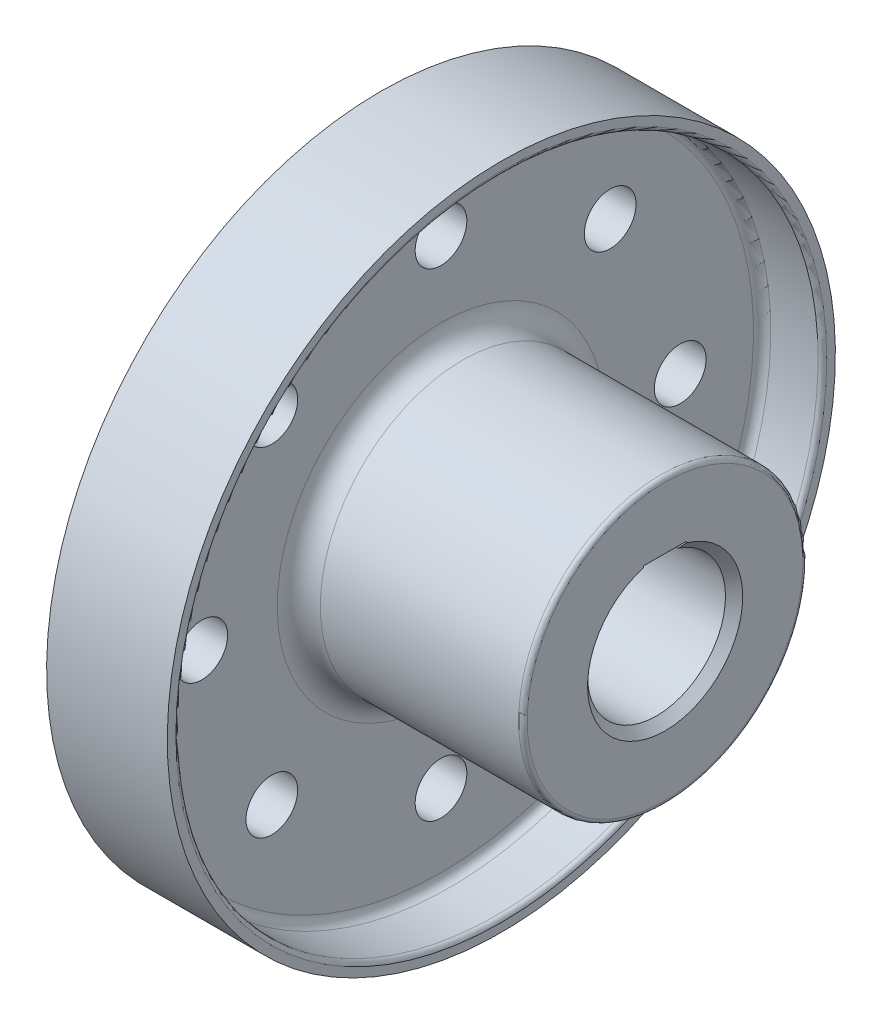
ISO-10303-21;
HEADER;
FILE_DESCRIPTION(('STEP AP214'),'2;1');
FILE_NAME('part.step','',(''),(''),'','','');
FILE_SCHEMA(('AUTOMOTIVE_DESIGN { 1 0 10303 214 1 1 1 1 }'));
ENDSEC;
DATA;
#1=APPLICATION_CONTEXT('core data for automotive mechanical design processes');
#2=APPLICATION_PROTOCOL_DEFINITION('international standard','automotive_design',2000,#1);
#3=PRODUCT_CONTEXT('',#1,'mechanical');
#4=PRODUCT('Part','Part','',(#3));
#5=PRODUCT_RELATED_PRODUCT_CATEGORY('part','',(#4));
#6=PRODUCT_DEFINITION_FORMATION('','',#4);
#7=PRODUCT_DEFINITION_CONTEXT('part definition',#1,'design');
#8=PRODUCT_DEFINITION('design','',#6,#7);
#9=PRODUCT_DEFINITION_SHAPE('','',#8);
#10=(LENGTH_UNIT() NAMED_UNIT(*) SI_UNIT(.MILLI.,.METRE.));
#11=(NAMED_UNIT(*) PLANE_ANGLE_UNIT() SI_UNIT($,.RADIAN.));
#12=(NAMED_UNIT(*) SI_UNIT($,.STERADIAN.) SOLID_ANGLE_UNIT());
#13=UNCERTAINTY_MEASURE_WITH_UNIT(LENGTH_MEASURE(1.E-05),#10,'distance_accuracy_value','');
#14=(GEOMETRIC_REPRESENTATION_CONTEXT(3) GLOBAL_UNCERTAINTY_ASSIGNED_CONTEXT((#13)) GLOBAL_UNIT_ASSIGNED_CONTEXT((#10,
#11,#12)) REPRESENTATION_CONTEXT('',''));
#15=CARTESIAN_POINT('',(0.,0.,0.));
#16=DIRECTION('',(0.,0.,1.));
#17=DIRECTION('',(1.,0.,0.));
#18=AXIS2_PLACEMENT_3D('',#15,#16,#17);
#19=CARTESIAN_POINT('',(7.19163547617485,0.,0.));
#20=DIRECTION('',(1.,0.,0.));
#21=DIRECTION('',(0.,1.,0.));
#22=AXIS2_PLACEMENT_3D('',#19,#20,#21);
#23=PLANE('',#22);
#24=CARTESIAN_POINT('',(7.19163547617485,0.,0.));
#25=DIRECTION('',(1.,0.,0.));
#26=DIRECTION('',(0.,1.,0.));
#27=AXIS2_PLACEMENT_3D('',#24,#25,#26);
#28=CIRCLE('',#27,32.);
#29=CARTESIAN_POINT('',(7.19163547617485,32.,0.));
#30=VERTEX_POINT('',#29);
#31=EDGE_CURVE('E275',#30,#30,#28,.T.);
#32=ORIENTED_EDGE('',*,*,#31,.T.);
#33=EDGE_LOOP('',(#32));
#34=FACE_BOUND('',#33,.T.);
#35=DIRECTION('',(0.,-1.,0.));
#36=VECTOR('',#35,1.);
#37=CARTESIAN_POINT('',(7.19163547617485,17.65,-5.));
#38=LINE('',#37,#36);
#39=CARTESIAN_POINT('',(7.19163547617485,17.65,-5.));
#40=VERTEX_POINT('',#39);
#41=CARTESIAN_POINT('',(7.19163547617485,17.2916164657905,-5.));
#42=VERTEX_POINT('',#41);
#43=EDGE_CURVE('E158',#40,#42,#38,.T.);
#44=ORIENTED_EDGE('',*,*,#43,.T.);
#45=CARTESIAN_POINT('',(7.19163547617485,0.,0.));
#46=DIRECTION('',(1.,0.,0.));
#47=DIRECTION('',(0.,1.,0.));
#48=AXIS2_PLACEMENT_3D('',#45,#46,#47);
#49=CIRCLE('',#48,17.9999999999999);
#50=CARTESIAN_POINT('',(7.19163547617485,17.2916164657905,5.));
#51=VERTEX_POINT('',#50);
#52=EDGE_CURVE('E184',#42,#51,#49,.F.);
#53=ORIENTED_EDGE('',*,*,#52,.T.);
#54=DIRECTION('',(0.,-1.,0.));
#55=VECTOR('',#54,1.);
#56=CARTESIAN_POINT('',(7.19163547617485,17.65,5.));
#57=LINE('',#56,#55);
#58=CARTESIAN_POINT('',(7.19163547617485,17.65,5.));
#59=VERTEX_POINT('',#58);
#60=EDGE_CURVE('E155',#59,#51,#57,.T.);
#61=ORIENTED_EDGE('',*,*,#60,.F.);
#62=DIRECTION('',(0.,0.,1.));
#63=VECTOR('',#62,1.);
#64=CARTESIAN_POINT('',(7.19163547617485,17.65,-5.));
#65=LINE('',#64,#63);
#66=EDGE_CURVE('E134',#40,#59,#65,.T.);
#67=ORIENTED_EDGE('',*,*,#66,.F.);
#68=EDGE_LOOP('',(#44,#53,#61,#67));
#69=FACE_BOUND('',#68,.T.);
#70=ADVANCED_FACE('F68',(#34,#69),#23,.T.);
#71=CARTESIAN_POINT('',(7.19163547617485,0.,0.));
#72=DIRECTION('',(1.,0.,0.));
#73=DIRECTION('',(0.,1.,0.));
#74=AXIS2_PLACEMENT_3D('',#71,#72,#73);
#75=CYLINDRICAL_SURFACE('',#74,33.);
#76=CARTESIAN_POINT('',(-39.8083645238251,0.,0.));
#77=DIRECTION('',(1.,0.,0.));
#78=DIRECTION('',(0.,1.,0.));
#79=AXIS2_PLACEMENT_3D('',#76,#77,#78);
#80=CIRCLE('',#79,33.);
#81=CARTESIAN_POINT('',(-39.8083645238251,33.,0.));
#82=VERTEX_POINT('',#81);
#83=EDGE_CURVE('E77',#82,#82,#80,.T.);
#84=ORIENTED_EDGE('',*,*,#83,.T.);
#85=EDGE_LOOP('',(#84));
#86=FACE_BOUND('',#85,.T.);
#87=CARTESIAN_POINT('',(6.19163547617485,0.,0.));
#88=DIRECTION('',(1.,0.,0.));
#89=DIRECTION('',(0.,1.,0.));
#90=AXIS2_PLACEMENT_3D('',#87,#88,#89);
#91=CIRCLE('',#90,33.);
#92=CARTESIAN_POINT('',(6.19163547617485,33.,0.));
#93=VERTEX_POINT('',#92);
#94=EDGE_CURVE('E300',#93,#93,#91,.F.);
#95=ORIENTED_EDGE('',*,*,#94,.T.);
#96=EDGE_LOOP('',(#95));
#97=FACE_BOUND('',#96,.T.);
#98=ADVANCED_FACE('F265',(#86,#97),#75,.T.);
#99=CARTESIAN_POINT('',(-44.8083645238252,33.,0.));
#100=DIRECTION('',(1.,0.,0.));
#101=DIRECTION('',(0.,1.,0.));
#102=AXIS2_PLACEMENT_3D('',#99,#100,#101);
#103=PLANE('',#102);
#104=CARTESIAN_POINT('',(-44.8083645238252,55.5,0.));
#105=DIRECTION('',(1.,0.,0.));
#106=DIRECTION('',(0.,1.,0.));
#107=AXIS2_PLACEMENT_3D('',#104,#105,#106);
#108=CIRCLE('',#107,6.);
#109=CARTESIAN_POINT('',(-44.8083645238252,61.5,0.));
#110=VERTEX_POINT('',#109);
#111=EDGE_CURVE('E148',#110,#110,#108,.T.);
#112=ORIENTED_EDGE('',*,*,#111,.F.);
#113=EDGE_LOOP('',(#112));
#114=FACE_BOUND('',#113,.T.);
#115=CARTESIAN_POINT('',(-44.8083645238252,39.2444263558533,39.2444263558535));
#116=DIRECTION('',(1.,0.,0.));
#117=DIRECTION('',(0.,1.,0.));
#118=AXIS2_PLACEMENT_3D('',#115,#116,#117);
#119=CIRCLE('',#118,6.);
#120=CARTESIAN_POINT('',(-44.8083645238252,45.2444263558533,39.2444263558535));
#121=VERTEX_POINT('',#120);
#122=EDGE_CURVE('E649',#121,#121,#119,.T.);
#123=ORIENTED_EDGE('',*,*,#122,.F.);
#124=EDGE_LOOP('',(#123));
#125=FACE_BOUND('',#124,.T.);
#126=CARTESIAN_POINT('',(-44.8083645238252,-1.91846352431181E-13,55.5));
#127=DIRECTION('',(1.,0.,0.));
#128=DIRECTION('',(0.,1.,0.));
#129=AXIS2_PLACEMENT_3D('',#126,#127,#128);
#130=CIRCLE('',#129,6.);
#131=CARTESIAN_POINT('',(-44.8083645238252,5.99999999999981,55.5));
#132=VERTEX_POINT('',#131);
#133=EDGE_CURVE('E646',#132,#132,#130,.T.);
#134=ORIENTED_EDGE('',*,*,#133,.F.);
#135=EDGE_LOOP('',(#134));
#136=FACE_BOUND('',#135,.T.);
#137=CARTESIAN_POINT('',(-44.8083645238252,-39.2444263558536,39.2444263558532));
#138=DIRECTION('',(1.,0.,0.));
#139=DIRECTION('',(0.,1.,0.));
#140=AXIS2_PLACEMENT_3D('',#137,#138,#139);
#141=CIRCLE('',#140,5.99999999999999);
#142=CARTESIAN_POINT('',(-44.8083645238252,-33.2444263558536,39.2444263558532));
#143=VERTEX_POINT('',#142);
#144=EDGE_CURVE('E642',#143,#143,#141,.T.);
#145=ORIENTED_EDGE('',*,*,#144,.F.);
#146=EDGE_LOOP('',(#145));
#147=FACE_BOUND('',#146,.T.);
#148=CARTESIAN_POINT('',(-44.8083645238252,-55.5,-3.87554428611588E-13));
#149=DIRECTION('',(1.,0.,0.));
#150=DIRECTION('',(0.,1.,0.));
#151=AXIS2_PLACEMENT_3D('',#148,#149,#150);
#152=CIRCLE('',#151,6.);
#153=CARTESIAN_POINT('',(-44.8083645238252,-49.5,-3.87554428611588E-13));
#154=VERTEX_POINT('',#153);
#155=EDGE_CURVE('E638',#154,#154,#152,.T.);
#156=ORIENTED_EDGE('',*,*,#155,.F.);
#157=EDGE_LOOP('',(#156));
#158=FACE_BOUND('',#157,.T.);
#159=CARTESIAN_POINT('',(-44.8083645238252,-39.2444263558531,-39.2444263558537));
#160=DIRECTION('',(1.,0.,0.));
#161=DIRECTION('',(0.,1.,0.));
#162=AXIS2_PLACEMENT_3D('',#159,#160,#161);
#163=CIRCLE('',#162,6.);
#164=CARTESIAN_POINT('',(-44.8083645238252,-33.244426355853,-39.2444263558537));
#165=VERTEX_POINT('',#164);
#166=EDGE_CURVE('E634',#165,#165,#163,.T.);
#167=ORIENTED_EDGE('',*,*,#166,.F.);
#168=EDGE_LOOP('',(#167));
#169=FACE_BOUND('',#168,.T.);
#170=CARTESIAN_POINT('',(-44.8083645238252,5.83262504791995E-13,-55.5));
#171=DIRECTION('',(1.,0.,0.));
#172=DIRECTION('',(0.,1.,0.));
#173=AXIS2_PLACEMENT_3D('',#170,#171,#172);
#174=CIRCLE('',#173,6.);
#175=CARTESIAN_POINT('',(-44.8083645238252,6.00000000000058,-55.5));
#176=VERTEX_POINT('',#175);
#177=EDGE_CURVE('E630',#176,#176,#174,.T.);
#178=ORIENTED_EDGE('',*,*,#177,.F.);
#179=EDGE_LOOP('',(#178));
#180=FACE_BOUND('',#179,.T.);
#181=CARTESIAN_POINT('',(-44.8083645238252,39.2444263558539,-39.2444263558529));
#182=DIRECTION('',(1.,0.,0.));
#183=DIRECTION('',(0.,1.,0.));
#184=AXIS2_PLACEMENT_3D('',#181,#182,#183);
#185=CIRCLE('',#184,6.);
#186=CARTESIAN_POINT('',(-44.8083645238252,45.2444263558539,-39.2444263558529));
#187=VERTEX_POINT('',#186);
#188=EDGE_CURVE('E626',#187,#187,#185,.T.);
#189=ORIENTED_EDGE('',*,*,#188,.F.);
#190=EDGE_LOOP('',(#189));
#191=FACE_BOUND('',#190,.T.);
#192=CARTESIAN_POINT('',(-44.8083645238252,0.,0.));
#193=DIRECTION('',(1.,0.,0.));
#194=DIRECTION('',(0.,1.,0.));
#195=AXIS2_PLACEMENT_3D('',#192,#193,#194);
#196=CIRCLE('',#195,38.);
#197=CARTESIAN_POINT('',(-44.8083645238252,38.,0.));
#198=VERTEX_POINT('',#197);
#199=EDGE_CURVE('E12',#198,#198,#196,.F.);
#200=ORIENTED_EDGE('',*,*,#199,.T.);
#201=EDGE_LOOP('',(#200));
#202=FACE_BOUND('',#201,.T.);
#203=CARTESIAN_POINT('',(-44.8083645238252,0.,0.));
#204=DIRECTION('',(1.,0.,0.));
#205=DIRECTION('',(0.,1.,0.));
#206=AXIS2_PLACEMENT_3D('',#203,#204,#205);
#207=CIRCLE('',#206,72.5);
#208=CARTESIAN_POINT('',(-44.8083645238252,72.5,0.));
#209=VERTEX_POINT('',#208);
#210=EDGE_CURVE('E305',#209,#209,#207,.T.);
#211=ORIENTED_EDGE('',*,*,#210,.T.);
#212=EDGE_LOOP('',(#211));
#213=FACE_BOUND('',#212,.T.);
#214=ADVANCED_FACE('F270',(#114,#125,#136,#147,#158,#169,#180,#191,#202,#213),#103,.T.);
#215=CARTESIAN_POINT('',(7.19163547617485,0.,0.));
#216=DIRECTION('',(1.,0.,0.));
#217=DIRECTION('',(0.,1.,0.));
#218=AXIS2_PLACEMENT_3D('',#215,#216,#217);
#219=CYLINDRICAL_SURFACE('',#218,74.5);
#220=CARTESIAN_POINT('',(-42.8083645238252,0.,0.));
#221=DIRECTION('',(1.,0.,0.));
#222=DIRECTION('',(0.,1.,0.));
#223=AXIS2_PLACEMENT_3D('',#220,#221,#222);
#224=CIRCLE('',#223,74.5);
#225=CARTESIAN_POINT('',(-42.8083645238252,74.5,0.));
#226=VERTEX_POINT('',#225);
#227=EDGE_CURVE('E310',#226,#226,#224,.F.);
#228=ORIENTED_EDGE('',*,*,#227,.T.);
#229=EDGE_LOOP('',(#228));
#230=FACE_BOUND('',#229,.T.);
#231=CARTESIAN_POINT('',(-31.8083645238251,0.,0.));
#232=DIRECTION('',(1.,0.,0.));
#233=DIRECTION('',(0.,1.,0.));
#234=AXIS2_PLACEMENT_3D('',#231,#232,#233);
#235=CIRCLE('',#234,74.5);
#236=CARTESIAN_POINT('',(-31.8083645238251,74.5,0.));
#237=VERTEX_POINT('',#236);
#238=EDGE_CURVE('E222',#237,#237,#235,.T.);
#239=ORIENTED_EDGE('',*,*,#238,.T.);
#240=EDGE_LOOP('',(#239));
#241=FACE_BOUND('',#240,.T.);
#242=ADVANCED_FACE('F334',(#230,#241),#219,.F.);
#243=CARTESIAN_POINT('',(-30.8083645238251,74.5,0.));
#244=DIRECTION('',(1.,0.,0.));
#245=DIRECTION('',(0.,1.,0.));
#246=AXIS2_PLACEMENT_3D('',#243,#244,#245);
#247=PLANE('',#246);
#248=CARTESIAN_POINT('',(-30.8083645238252,0.,0.));
#249=DIRECTION('',(1.,0.,0.));
#250=DIRECTION('',(0.,1.,0.));
#251=AXIS2_PLACEMENT_3D('',#248,#249,#250);
#252=CIRCLE('',#251,75.5);
#253=CARTESIAN_POINT('',(-30.8083645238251,75.5,0.));
#254=VERTEX_POINT('',#253);
#255=EDGE_CURVE('E294',#254,#254,#252,.F.);
#256=ORIENTED_EDGE('',*,*,#255,.T.);
#257=EDGE_LOOP('',(#256));
#258=FACE_BOUND('',#257,.T.);
#259=CARTESIAN_POINT('',(-30.8083645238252,0.,0.));
#260=DIRECTION('',(1.,0.,0.));
#261=DIRECTION('',(0.,1.,0.));
#262=AXIS2_PLACEMENT_3D('',#259,#260,#261);
#263=CIRCLE('',#262,77.5);
#264=CARTESIAN_POINT('',(-30.8083645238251,77.5,0.));
#265=VERTEX_POINT('',#264);
#266=EDGE_CURVE('E180',#265,#265,#263,.T.);
#267=ORIENTED_EDGE('',*,*,#266,.T.);
#268=EDGE_LOOP('',(#267));
#269=FACE_BOUND('',#268,.T.);
#270=ADVANCED_FACE('F342',(#258,#269),#247,.T.);
#271=CARTESIAN_POINT('',(7.19163547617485,0.,0.));
#272=DIRECTION('',(1.,0.,0.));
#273=DIRECTION('',(0.,1.,0.));
#274=AXIS2_PLACEMENT_3D('',#271,#272,#273);
#275=CYLINDRICAL_SURFACE('',#274,77.5);
#276=CARTESIAN_POINT('',(-58.8083645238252,0.,0.));
#277=DIRECTION('',(1.,0.,0.));
#278=DIRECTION('',(0.,1.,0.));
#279=AXIS2_PLACEMENT_3D('',#276,#277,#278);
#280=CIRCLE('',#279,77.5);
#281=CARTESIAN_POINT('',(-58.8083645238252,77.5,0.));
#282=VERTEX_POINT('',#281);
#283=EDGE_CURVE('E173',#282,#282,#280,.T.);
#284=ORIENTED_EDGE('',*,*,#283,.T.);
#285=EDGE_LOOP('',(#284));
#286=FACE_BOUND('',#285,.T.);
#287=ORIENTED_EDGE('',*,*,#266,.F.);
#288=EDGE_LOOP('',(#287));
#289=FACE_BOUND('',#288,.T.);
#290=ADVANCED_FACE('F350',(#286,#289),#275,.T.);
#291=CARTESIAN_POINT('',(-58.8083645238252,77.5,0.));
#292=DIRECTION('',(-1.,0.,0.));
#293=DIRECTION('',(0.,-1.,0.));
#294=AXIS2_PLACEMENT_3D('',#291,#292,#293);
#295=PLANE('',#294);
#296=CARTESIAN_POINT('',(-58.8083645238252,55.5,0.));
#297=DIRECTION('',(-1.,0.,0.));
#298=DIRECTION('',(0.,-1.,0.));
#299=AXIS2_PLACEMENT_3D('',#296,#297,#298);
#300=CIRCLE('',#299,6.);
#301=CARTESIAN_POINT('',(-58.8083645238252,49.5,0.));
#302=VERTEX_POINT('',#301);
#303=EDGE_CURVE('E590',#302,#302,#300,.T.);
#304=ORIENTED_EDGE('',*,*,#303,.F.);
#305=EDGE_LOOP('',(#304));
#306=FACE_BOUND('',#305,.T.);
#307=CARTESIAN_POINT('',(-58.8083645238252,39.2444263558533,39.2444263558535));
#308=DIRECTION('',(-1.,0.,0.));
#309=DIRECTION('',(0.,-1.,0.));
#310=AXIS2_PLACEMENT_3D('',#307,#308,#309);
#311=CIRCLE('',#310,6.);
#312=CARTESIAN_POINT('',(-58.8083645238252,33.2444263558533,39.2444263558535));
#313=VERTEX_POINT('',#312);
#314=EDGE_CURVE('E594',#313,#313,#311,.T.);
#315=ORIENTED_EDGE('',*,*,#314,.F.);
#316=EDGE_LOOP('',(#315));
#317=FACE_BOUND('',#316,.T.);
#318=CARTESIAN_POINT('',(-58.8083645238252,-1.91243070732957E-13,55.5));
#319=DIRECTION('',(-1.,0.,0.));
#320=DIRECTION('',(0.,-1.,0.));
#321=AXIS2_PLACEMENT_3D('',#318,#319,#320);
#322=CIRCLE('',#321,6.);
#323=CARTESIAN_POINT('',(-58.8083645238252,-6.00000000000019,55.5));
#324=VERTEX_POINT('',#323);
#325=EDGE_CURVE('E598',#324,#324,#322,.T.);
#326=ORIENTED_EDGE('',*,*,#325,.F.);
#327=EDGE_LOOP('',(#326));
#328=FACE_BOUND('',#327,.T.);
#329=CARTESIAN_POINT('',(-58.8083645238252,-39.2444263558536,39.2444263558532));
#330=DIRECTION('',(-1.,0.,0.));
#331=DIRECTION('',(0.,-1.,0.));
#332=AXIS2_PLACEMENT_3D('',#329,#330,#331);
#333=CIRCLE('',#332,5.99999999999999);
#334=CARTESIAN_POINT('',(-58.8083645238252,-45.2444263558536,39.2444263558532));
#335=VERTEX_POINT('',#334);
#336=EDGE_CURVE('E602',#335,#335,#333,.T.);
#337=ORIENTED_EDGE('',*,*,#336,.F.);
#338=EDGE_LOOP('',(#337));
#339=FACE_BOUND('',#338,.T.);
#340=CARTESIAN_POINT('',(-58.8083645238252,-55.5,-3.87554428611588E-13));
#341=DIRECTION('',(-1.,0.,0.));
#342=DIRECTION('',(0.,-1.,0.));
#343=AXIS2_PLACEMENT_3D('',#340,#341,#342);
#344=CIRCLE('',#343,6.);
#345=CARTESIAN_POINT('',(-58.8083645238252,-61.5,-3.87554428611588E-13));
#346=VERTEX_POINT('',#345);
#347=EDGE_CURVE('E606',#346,#346,#344,.T.);
#348=ORIENTED_EDGE('',*,*,#347,.F.);
#349=EDGE_LOOP('',(#348));
#350=FACE_BOUND('',#349,.T.);
#351=CARTESIAN_POINT('',(-58.8083645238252,-39.2444263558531,-39.2444263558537));
#352=DIRECTION('',(-1.,0.,0.));
#353=DIRECTION('',(0.,-1.,0.));
#354=AXIS2_PLACEMENT_3D('',#351,#352,#353);
#355=CIRCLE('',#354,6.);
#356=CARTESIAN_POINT('',(-58.8083645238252,-45.2444263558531,-39.2444263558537));
#357=VERTEX_POINT('',#356);
#358=EDGE_CURVE('E610',#357,#357,#355,.T.);
#359=ORIENTED_EDGE('',*,*,#358,.F.);
#360=EDGE_LOOP('',(#359));
#361=FACE_BOUND('',#360,.T.);
#362=CARTESIAN_POINT('',(-58.8083645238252,5.83865786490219E-13,-55.5));
#363=DIRECTION('',(-1.,0.,0.));
#364=DIRECTION('',(0.,-1.,0.));
#365=AXIS2_PLACEMENT_3D('',#362,#363,#364);
#366=CIRCLE('',#365,6.);
#367=CARTESIAN_POINT('',(-58.8083645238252,-5.99999999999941,-55.5));
#368=VERTEX_POINT('',#367);
#369=EDGE_CURVE('E614',#368,#368,#366,.T.);
#370=ORIENTED_EDGE('',*,*,#369,.F.);
#371=EDGE_LOOP('',(#370));
#372=FACE_BOUND('',#371,.T.);
#373=CARTESIAN_POINT('',(-58.8083645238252,39.2444263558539,-39.2444263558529));
#374=DIRECTION('',(-1.,0.,0.));
#375=DIRECTION('',(0.,-1.,0.));
#376=AXIS2_PLACEMENT_3D('',#373,#374,#375);
#377=CIRCLE('',#376,6.);
#378=CARTESIAN_POINT('',(-58.8083645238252,33.2444263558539,-39.2444263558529));
#379=VERTEX_POINT('',#378);
#380=EDGE_CURVE('E617',#379,#379,#377,.T.);
#381=ORIENTED_EDGE('',*,*,#380,.F.);
#382=EDGE_LOOP('',(#381));
#383=FACE_BOUND('',#382,.T.);
#384=CARTESIAN_POINT('',(-58.8083645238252,0.,0.));
#385=DIRECTION('',(-1.,0.,0.));
#386=DIRECTION('',(0.,-1.,0.));
#387=AXIS2_PLACEMENT_3D('',#384,#385,#386);
#388=CIRCLE('',#387,27.5);
#389=CARTESIAN_POINT('',(-58.8083645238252,-27.5,0.));
#390=VERTEX_POINT('',#389);
#391=EDGE_CURVE('E151',#390,#390,#388,.T.);
#392=ORIENTED_EDGE('',*,*,#391,.F.);
#393=EDGE_LOOP('',(#392));
#394=FACE_BOUND('',#393,.T.);
#395=ORIENTED_EDGE('',*,*,#283,.F.);
#396=EDGE_LOOP('',(#395));
#397=FACE_BOUND('',#396,.T.);
#398=ADVANCED_FACE('F354',(#306,#317,#328,#339,#350,#361,#372,#383,#394,#397),#295,.T.);
#399=CARTESIAN_POINT('',(-52.8083645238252,0.,0.));
#400=DIRECTION('',(-1.,0.,0.));
#401=DIRECTION('',(0.,-1.,0.));
#402=AXIS2_PLACEMENT_3D('',#399,#400,#401);
#403=CYLINDRICAL_SURFACE('',#402,27.5);
#404=CARTESIAN_POINT('',(-52.8083645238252,0.,0.));
#405=DIRECTION('',(-1.,0.,0.));
#406=DIRECTION('',(0.,-1.,0.));
#407=AXIS2_PLACEMENT_3D('',#404,#405,#406);
#408=CIRCLE('',#407,27.5);
#409=CARTESIAN_POINT('',(-52.8083645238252,-27.5,0.));
#410=VERTEX_POINT('',#409);
#411=EDGE_CURVE('E169',#410,#410,#408,.T.);
#412=ORIENTED_EDGE('',*,*,#411,.F.);
#413=EDGE_LOOP('',(#412));
#414=FACE_BOUND('',#413,.T.);
#415=ORIENTED_EDGE('',*,*,#391,.T.);
#416=EDGE_LOOP('',(#415));
#417=FACE_BOUND('',#416,.T.);
#418=ADVANCED_FACE('F358',(#414,#417),#403,.F.);
#419=CARTESIAN_POINT('',(-52.8083645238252,0.,0.));
#420=DIRECTION('',(-1.,0.,0.));
#421=DIRECTION('',(0.,-1.,0.));
#422=AXIS2_PLACEMENT_3D('',#419,#420,#421);
#423=PLANE('',#422);
#424=DIRECTION('',(0.,-1.,0.));
#425=VECTOR('',#424,1.);
#426=CARTESIAN_POINT('',(-52.8083645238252,17.65,-5.));
#427=LINE('',#426,#425);
#428=CARTESIAN_POINT('',(-52.8083645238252,17.65,-5.));
#429=VERTEX_POINT('',#428);
#430=CARTESIAN_POINT('',(-52.8083645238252,15.1986841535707,-5.));
#431=VERTEX_POINT('',#430);
#432=EDGE_CURVE('E126',#429,#431,#427,.T.);
#433=ORIENTED_EDGE('',*,*,#432,.F.);
#434=DIRECTION('',(0.,0.,1.));
#435=VECTOR('',#434,1.);
#436=CARTESIAN_POINT('',(-52.8083645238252,17.65,-5.));
#437=LINE('',#436,#435);
#438=CARTESIAN_POINT('',(-52.8083645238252,17.65,5.));
#439=VERTEX_POINT('',#438);
#440=EDGE_CURVE('E162',#429,#439,#437,.T.);
#441=ORIENTED_EDGE('',*,*,#440,.T.);
#442=DIRECTION('',(0.,-1.,0.));
#443=VECTOR('',#442,1.);
#444=CARTESIAN_POINT('',(-52.8083645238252,17.65,5.));
#445=LINE('',#444,#443);
#446=CARTESIAN_POINT('',(-52.8083645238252,15.1986841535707,5.));
#447=VERTEX_POINT('',#446);
#448=EDGE_CURVE('E135',#439,#447,#445,.T.);
#449=ORIENTED_EDGE('',*,*,#448,.T.);
#450=CARTESIAN_POINT('',(-52.8083645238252,0.,0.));
#451=DIRECTION('',(-1.,0.,0.));
#452=DIRECTION('',(0.,0.,1.));
#453=AXIS2_PLACEMENT_3D('',#450,#451,#452);
#454=CIRCLE('',#453,16.);
#455=EDGE_CURVE('E118',#431,#447,#454,.T.);
#456=ORIENTED_EDGE('',*,*,#455,.F.);
#457=EDGE_LOOP('',(#433,#441,#449,#456));
#458=FACE_BOUND('',#457,.T.);
#459=ORIENTED_EDGE('',*,*,#411,.T.);
#460=EDGE_LOOP('',(#459));
#461=FACE_BOUND('',#460,.T.);
#462=ADVANCED_FACE('F137',(#458,#461),#423,.T.);
#463=CARTESIAN_POINT('',(7.19163547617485,0.,0.));
#464=DIRECTION('',(-1.,0.,0.));
#465=DIRECTION('',(0.,-1.,0.));
#466=AXIS2_PLACEMENT_3D('',#463,#464,#465);
#467=CYLINDRICAL_SURFACE('',#466,16.);
#468=DIRECTION('',(-1.,0.,0.));
#469=VECTOR('',#468,1.);
#470=CARTESIAN_POINT('',(7.19163547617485,15.1986841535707,5.));
#471=LINE('',#470,#469);
#472=CARTESIAN_POINT('',(5.19163547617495,15.1986841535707,5.));
#473=VERTEX_POINT('',#472);
#474=EDGE_CURVE('E123',#473,#447,#471,.T.);
#475=ORIENTED_EDGE('',*,*,#474,.F.);
#476=CARTESIAN_POINT('',(5.19163547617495,0.,0.));
#477=DIRECTION('',(1.,0.,0.));
#478=DIRECTION('',(0.,1.,0.));
#479=AXIS2_PLACEMENT_3D('',#476,#477,#478);
#480=CIRCLE('',#479,16.);
#481=CARTESIAN_POINT('',(5.19163547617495,15.1986841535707,-5.));
#482=VERTEX_POINT('',#481);
#483=EDGE_CURVE('E84',#473,#482,#480,.T.);
#484=ORIENTED_EDGE('',*,*,#483,.T.);
#485=DIRECTION('',(-1.,0.,0.));
#486=VECTOR('',#485,1.);
#487=CARTESIAN_POINT('',(7.19163547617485,15.1986841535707,-5.));
#488=LINE('',#487,#486);
#489=EDGE_CURVE('E114',#482,#431,#488,.T.);
#490=ORIENTED_EDGE('',*,*,#489,.T.);
#491=ORIENTED_EDGE('',*,*,#455,.T.);
#492=EDGE_LOOP('',(#475,#484,#490,#491));
#493=FACE_BOUND('',#492,.T.);
#494=ADVANCED_FACE('F116',(#493),#467,.F.);
#495=CARTESIAN_POINT('',(7.19163547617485,17.65,5.));
#496=DIRECTION('',(0.,0.,-1.));
#497=DIRECTION('',(-1.,0.,0.));
#498=AXIS2_PLACEMENT_3D('',#495,#496,#497);
#499=PLANE('',#498);
#500=ORIENTED_EDGE('',*,*,#60,.T.);
#501=CARTESIAN_POINT('',(7.19163547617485,17.2916164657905,5.));
#502=CARTESIAN_POINT('',(7.02451036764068,17.1176440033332,5.));
#503=CARTESIAN_POINT('',(6.85748569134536,16.9435750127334,5.));
#504=CARTESIAN_POINT('',(6.5236582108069,16.5952250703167,5.));
#505=CARTESIAN_POINT('',(6.35685540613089,16.4209441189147,5.));
#506=CARTESIAN_POINT('',(6.02349196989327,16.0721506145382,5.));
#507=CARTESIAN_POINT('',(5.85693133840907,15.8976380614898,5.));
#508=CARTESIAN_POINT('',(5.52407693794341,15.5483580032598,5.));
#509=CARTESIAN_POINT('',(5.35778316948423,15.3735904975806,5.));
#510=CARTESIAN_POINT('',(5.19163547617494,15.1986841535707,5.));
#511=B_SPLINE_CURVE_WITH_KNOTS('',3,(#501,#502,#503,#504,#505,#506,#507,#508,#509,#510),
.UNSPECIFIED.,.F.,.F.,(4,2,2,2,4),(0.,0.723723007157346,1.44744460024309,2.17116642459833,
2.89488966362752),.UNSPECIFIED.);
#512=EDGE_CURVE('E92',#51,#473,#511,.T.);
#513=ORIENTED_EDGE('',*,*,#512,.T.);
#514=ORIENTED_EDGE('',*,*,#474,.T.);
#515=ORIENTED_EDGE('',*,*,#448,.F.);
#516=DIRECTION('',(-1.,0.,0.));
#517=VECTOR('',#516,1.);
#518=CARTESIAN_POINT('',(7.19163547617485,17.65,5.));
#519=LINE('',#518,#517);
#520=EDGE_CURVE('E141',#59,#439,#519,.T.);
#521=ORIENTED_EDGE('',*,*,#520,.F.);
#522=EDGE_LOOP('',(#500,#513,#514,#515,#521));
#523=FACE_BOUND('',#522,.T.);
#524=ADVANCED_FACE('F197',(#523),#499,.T.);
#525=CARTESIAN_POINT('',(7.19163547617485,17.65,-5.));
#526=DIRECTION('',(0.,0.,-1.));
#527=DIRECTION('',(-1.,0.,0.));
#528=AXIS2_PLACEMENT_3D('',#525,#526,#527);
#529=PLANE('',#528);
#530=ORIENTED_EDGE('',*,*,#489,.F.);
#531=CARTESIAN_POINT('',(5.19163547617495,15.1986841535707,-5.));
#532=CARTESIAN_POINT('',(5.35778316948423,15.3735904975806,-5.));
#533=CARTESIAN_POINT('',(5.52407693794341,15.5483580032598,-5.));
#534=CARTESIAN_POINT('',(5.85693133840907,15.8976380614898,-5.));
#535=CARTESIAN_POINT('',(6.02349196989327,16.0721506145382,-5.));
#536=CARTESIAN_POINT('',(6.35685540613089,16.4209441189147,-5.));
#537=CARTESIAN_POINT('',(6.5236582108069,16.5952250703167,-5.));
#538=CARTESIAN_POINT('',(6.85748569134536,16.9435750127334,-5.));
#539=CARTESIAN_POINT('',(7.02451036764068,17.1176440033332,-5.));
#540=CARTESIAN_POINT('',(7.19163547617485,17.2916164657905,-5.));
#541=B_SPLINE_CURVE_WITH_KNOTS('',3,(#531,#532,#533,#534,#535,#536,#537,#538,#539,#540),
.UNSPECIFIED.,.F.,.F.,(4,2,2,2,4),(0.,0.723723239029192,1.44744506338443,2.17116665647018,
2.89488966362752),.UNSPECIFIED.);
#542=EDGE_CURVE('E215',#482,#42,#541,.T.);
#543=ORIENTED_EDGE('',*,*,#542,.T.);
#544=ORIENTED_EDGE('',*,*,#43,.F.);
#545=DIRECTION('',(-1.,0.,0.));
#546=VECTOR('',#545,1.);
#547=CARTESIAN_POINT('',(7.19163547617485,17.65,-5.));
#548=LINE('',#547,#546);
#549=EDGE_CURVE('E129',#40,#429,#548,.T.);
#550=ORIENTED_EDGE('',*,*,#549,.T.);
#551=ORIENTED_EDGE('',*,*,#432,.T.);
#552=EDGE_LOOP('',(#530,#543,#544,#550,#551));
#553=FACE_BOUND('',#552,.T.);
#554=ADVANCED_FACE('F127',(#553),#529,.F.);
#555=CARTESIAN_POINT('',(7.19163547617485,17.65,-5.));
#556=DIRECTION('',(0.,-1.,0.));
#557=DIRECTION('',(1.,0.,0.));
#558=AXIS2_PLACEMENT_3D('',#555,#556,#557);
#559=PLANE('',#558);
#560=ORIENTED_EDGE('',*,*,#440,.F.);
#561=ORIENTED_EDGE('',*,*,#549,.F.);
#562=ORIENTED_EDGE('',*,*,#66,.T.);
#563=ORIENTED_EDGE('',*,*,#520,.T.);
#564=EDGE_LOOP('',(#560,#561,#562,#563));
#565=FACE_BOUND('',#564,.T.);
#566=ADVANCED_FACE('F210',(#565),#559,.T.);
#567=CARTESIAN_POINT('',(7.19163547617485,0.,0.));
#568=DIRECTION('',(1.,0.,0.));
#569=DIRECTION('',(0.,1.,0.));
#570=AXIS2_PLACEMENT_3D('',#567,#568,#569);
#571=CONICAL_SURFACE('',#570,17.9999999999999,0.785398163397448);
#572=ORIENTED_EDGE('',*,*,#542,.F.);
#573=ORIENTED_EDGE('',*,*,#483,.F.);
#574=ORIENTED_EDGE('',*,*,#512,.F.);
#575=ORIENTED_EDGE('',*,*,#52,.F.);
#576=EDGE_LOOP('',(#572,#573,#574,#575));
#577=FACE_BOUND('',#576,.T.);
#578=ADVANCED_FACE('F202',(#577),#571,.F.);
#579=CARTESIAN_POINT('',(-31.8083645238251,0.,0.));
#580=DIRECTION('',(1.,0.,0.));
#581=DIRECTION('',(0.,1.,0.));
#582=AXIS2_PLACEMENT_3D('',#579,#580,#581);
#583=TOROIDAL_SURFACE('',#582,75.5,1.);
#584=ORIENTED_EDGE('',*,*,#255,.F.);
#585=EDGE_LOOP('',(#584));
#586=FACE_BOUND('',#585,.T.);
#587=ORIENTED_EDGE('',*,*,#238,.F.);
#588=EDGE_LOOP('',(#587));
#589=FACE_BOUND('',#588,.T.);
#590=ADVANCED_FACE('F209',(#586,#589),#583,.T.);
#591=CARTESIAN_POINT('',(6.19163547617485,0.,0.));
#592=DIRECTION('',(1.,0.,0.));
#593=DIRECTION('',(0.,1.,0.));
#594=AXIS2_PLACEMENT_3D('',#591,#592,#593);
#595=TOROIDAL_SURFACE('',#594,32.,1.);
#596=ORIENTED_EDGE('',*,*,#94,.F.);
#597=EDGE_LOOP('',(#596));
#598=FACE_BOUND('',#597,.T.);
#599=ORIENTED_EDGE('',*,*,#31,.F.);
#600=EDGE_LOOP('',(#599));
#601=FACE_BOUND('',#600,.T.);
#602=ADVANCED_FACE('F328',(#598,#601),#595,.T.);
#603=CARTESIAN_POINT('',(-42.8083645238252,0.,0.));
#604=DIRECTION('',(1.,0.,0.));
#605=DIRECTION('',(0.,1.,0.));
#606=AXIS2_PLACEMENT_3D('',#603,#604,#605);
#607=TOROIDAL_SURFACE('',#606,72.5,2.);
#608=ORIENTED_EDGE('',*,*,#227,.F.);
#609=EDGE_LOOP('',(#608));
#610=FACE_BOUND('',#609,.T.);
#611=ORIENTED_EDGE('',*,*,#210,.F.);
#612=EDGE_LOOP('',(#611));
#613=FACE_BOUND('',#612,.T.);
#614=ADVANCED_FACE('F323',(#610,#613),#607,.F.);
#615=CARTESIAN_POINT('',(-39.8083645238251,0.,0.));
#616=DIRECTION('',(1.,0.,0.));
#617=DIRECTION('',(0.,1.,0.));
#618=AXIS2_PLACEMENT_3D('',#615,#616,#617);
#619=TOROIDAL_SURFACE('',#618,38.,5.);
#620=ORIENTED_EDGE('',*,*,#199,.F.);
#621=EDGE_LOOP('',(#620));
#622=FACE_BOUND('',#621,.T.);
#623=ORIENTED_EDGE('',*,*,#83,.F.);
#624=EDGE_LOOP('',(#623));
#625=FACE_BOUND('',#624,.T.);
#626=ADVANCED_FACE('F70',(#622,#625),#619,.F.);
#627=CARTESIAN_POINT('',(7.19163547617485,39.2444263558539,-39.2444263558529));
#628=DIRECTION('',(-1.,0.,0.));
#629=DIRECTION('',(0.,-1.,0.));
#630=AXIS2_PLACEMENT_3D('',#627,#628,#629);
#631=CYLINDRICAL_SURFACE('',#630,6.);
#632=ORIENTED_EDGE('',*,*,#188,.T.);
#633=EDGE_LOOP('',(#632));
#634=FACE_BOUND('',#633,.T.);
#635=ORIENTED_EDGE('',*,*,#380,.T.);
#636=EDGE_LOOP('',(#635));
#637=FACE_BOUND('',#636,.T.);
#638=ADVANCED_FACE('F229',(#634,#637),#631,.F.);
#639=CARTESIAN_POINT('',(7.19163547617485,5.81021744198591E-13,-55.5));
#640=DIRECTION('',(-1.,0.,0.));
#641=DIRECTION('',(0.,-1.,0.));
#642=AXIS2_PLACEMENT_3D('',#639,#640,#641);
#643=CYLINDRICAL_SURFACE('',#642,6.);
#644=ORIENTED_EDGE('',*,*,#177,.T.);
#645=EDGE_LOOP('',(#644));
#646=FACE_BOUND('',#645,.T.);
#647=ORIENTED_EDGE('',*,*,#369,.T.);
#648=EDGE_LOOP('',(#647));
#649=FACE_BOUND('',#648,.T.);
#650=ADVANCED_FACE('F232',(#646,#649),#643,.F.);
#651=CARTESIAN_POINT('',(7.19163547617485,-39.2444263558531,-39.2444263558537));
#652=DIRECTION('',(-1.,0.,0.));
#653=DIRECTION('',(0.,-1.,0.));
#654=AXIS2_PLACEMENT_3D('',#651,#652,#653);
#655=CYLINDRICAL_SURFACE('',#654,6.);
#656=ORIENTED_EDGE('',*,*,#166,.T.);
#657=EDGE_LOOP('',(#656));
#658=FACE_BOUND('',#657,.T.);
#659=ORIENTED_EDGE('',*,*,#358,.T.);
#660=EDGE_LOOP('',(#659));
#661=FACE_BOUND('',#660,.T.);
#662=ADVANCED_FACE('F236',(#658,#661),#655,.F.);
#663=CARTESIAN_POINT('',(7.19163547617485,-55.5,-3.87554428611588E-13));
#664=DIRECTION('',(-1.,0.,0.));
#665=DIRECTION('',(0.,-1.,0.));
#666=AXIS2_PLACEMENT_3D('',#663,#664,#665);
#667=CYLINDRICAL_SURFACE('',#666,6.);
#668=ORIENTED_EDGE('',*,*,#155,.T.);
#669=EDGE_LOOP('',(#668));
#670=FACE_BOUND('',#669,.T.);
#671=ORIENTED_EDGE('',*,*,#347,.T.);
#672=EDGE_LOOP('',(#671));
#673=FACE_BOUND('',#672,.T.);
#674=ADVANCED_FACE('F240',(#670,#673),#667,.F.);
#675=CARTESIAN_POINT('',(7.19163547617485,-39.2444263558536,39.2444263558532));
#676=DIRECTION('',(-1.,0.,0.));
#677=DIRECTION('',(0.,-1.,0.));
#678=AXIS2_PLACEMENT_3D('',#675,#676,#677);
#679=CYLINDRICAL_SURFACE('',#678,5.99999999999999);
#680=ORIENTED_EDGE('',*,*,#144,.T.);
#681=EDGE_LOOP('',(#680));
#682=FACE_BOUND('',#681,.T.);
#683=ORIENTED_EDGE('',*,*,#336,.T.);
#684=EDGE_LOOP('',(#683));
#685=FACE_BOUND('',#684,.T.);
#686=ADVANCED_FACE('F244',(#682,#685),#679,.F.);
#687=CARTESIAN_POINT('',(7.19163547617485,-1.94087113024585E-13,55.5));
#688=DIRECTION('',(-1.,0.,0.));
#689=DIRECTION('',(0.,-1.,0.));
#690=AXIS2_PLACEMENT_3D('',#687,#688,#689);
#691=CYLINDRICAL_SURFACE('',#690,6.);
#692=ORIENTED_EDGE('',*,*,#133,.T.);
#693=EDGE_LOOP('',(#692));
#694=FACE_BOUND('',#693,.T.);
#695=ORIENTED_EDGE('',*,*,#325,.T.);
#696=EDGE_LOOP('',(#695));
#697=FACE_BOUND('',#696,.T.);
#698=ADVANCED_FACE('F248',(#694,#697),#691,.F.);
#699=CARTESIAN_POINT('',(7.19163547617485,39.2444263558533,39.2444263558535));
#700=DIRECTION('',(-1.,0.,0.));
#701=DIRECTION('',(0.,-1.,0.));
#702=AXIS2_PLACEMENT_3D('',#699,#700,#701);
#703=CYLINDRICAL_SURFACE('',#702,6.);
#704=ORIENTED_EDGE('',*,*,#122,.T.);
#705=EDGE_LOOP('',(#704));
#706=FACE_BOUND('',#705,.T.);
#707=ORIENTED_EDGE('',*,*,#314,.T.);
#708=EDGE_LOOP('',(#707));
#709=FACE_BOUND('',#708,.T.);
#710=ADVANCED_FACE('F252',(#706,#709),#703,.F.);
#711=CARTESIAN_POINT('',(7.19163547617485,55.5,0.));
#712=DIRECTION('',(-1.,0.,0.));
#713=DIRECTION('',(0.,-1.,0.));
#714=AXIS2_PLACEMENT_3D('',#711,#712,#713);
#715=CYLINDRICAL_SURFACE('',#714,6.);
#716=ORIENTED_EDGE('',*,*,#111,.T.);
#717=EDGE_LOOP('',(#716));
#718=FACE_BOUND('',#717,.T.);
#719=ORIENTED_EDGE('',*,*,#303,.T.);
#720=EDGE_LOOP('',(#719));
#721=FACE_BOUND('',#720,.T.);
#722=ADVANCED_FACE('F256',(#718,#721),#715,.F.);
#723=CLOSED_SHELL('',(#70,#98,#214,#242,#270,#290,#398,#418,#462,#494,#524,#554,#566,#578,#590,
#602,#614,#626,#638,#650,#662,#674,#686,#698,#710,#722));
#724=MANIFOLD_SOLID_BREP('B2',#723);
#725=ADVANCED_BREP_SHAPE_REPRESENTATION('',(#18,#724),#14);
#726=SHAPE_DEFINITION_REPRESENTATION(#9,#725);
ENDSEC;
END-ISO-10303-21;
